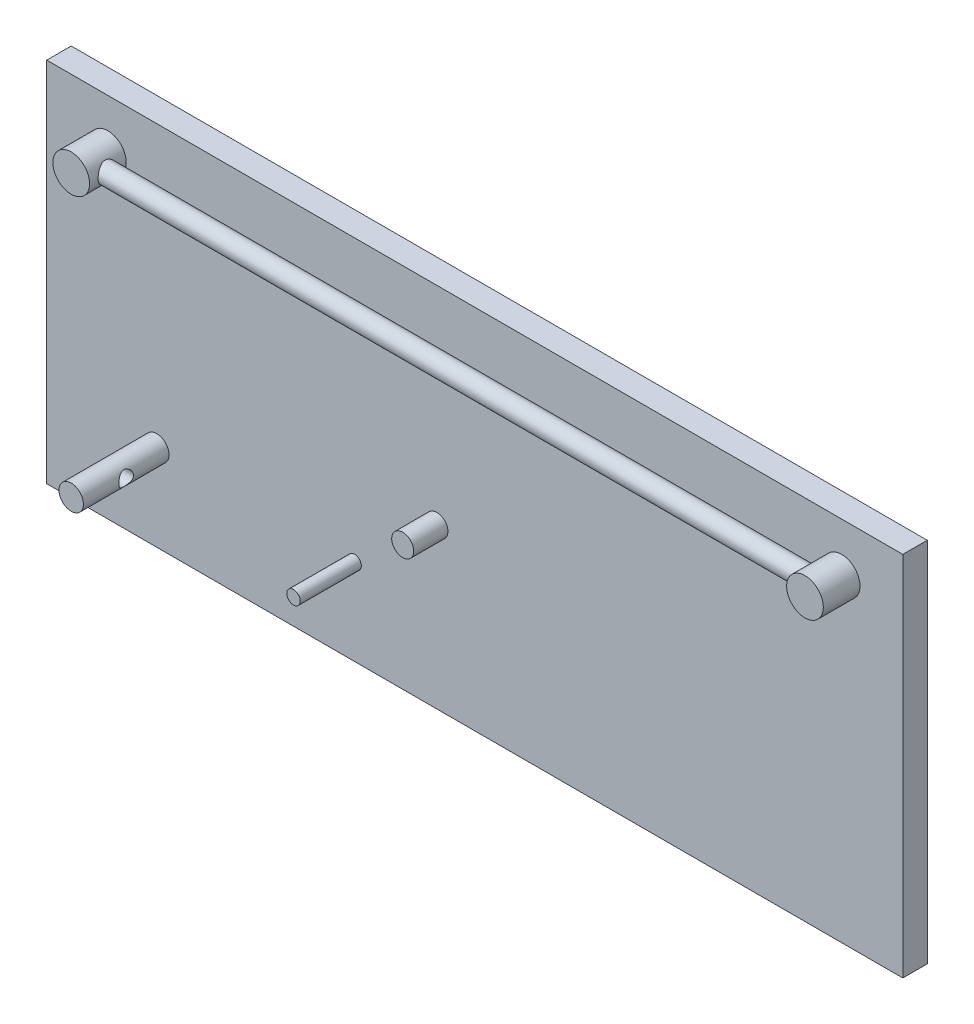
from build123d import *

# Parameters (mm, degrees)
SKETCH1_W                       = 350
SKETCH1_H                       = 150
EXTRUDE1_DEPTH                  = 10
SKETCH2_R                       = 7.5
EXTRUDE2_DEPTH                  = 15
EXTRUDE3_REACH                  = 194.029
EXTRUDE3_END_RADIUS             = 7.5
SKETCH3_R                       = 4
EXTRUDE3_DIRECTION_2_REACH      = 194.029
EXTRUDE3_DIRECTION_2_END_RADIUS = 7.5
SKETCH4_R                       = 4.5
EXTRUDE4_DEPTH                  = 14
SKETCH5_R                       = 5
EXTRUDE5_DEPTH                  = 35
CUT_EXTRUDE1_REACH              = 362.763
SKETCH6_R                       = 3
SKETCH7_R                       = 2.75
EXTRUDE6_DEPTH                  = 25


with BuildPart() as part:
    # Sketch1 → Extrude1 (new body)
    with BuildSketch(Plane.XY):
        Rectangle(SKETCH1_W, SKETCH1_H)
    extrude(amount=EXTRUDE1_DEPTH)

    # Sketch2 → Extrude2 (add)
    with BuildSketch(Plane.XY.offset(10)):
        with Locations((150, 55)):
            Circle(SKETCH2_R)
        with Locations(Location((-150, 55, 0), (0, 0, 180))):
            Circle(SKETCH2_R)
    extrude(amount=EXTRUDE2_DEPTH)

    # Extrude3: up to this cylinder (the profile starts outside it)
    extrude3_end = Plane(origin=(150, 55, 17.5), z_dir=(0, 0, -1)) * Cylinder(EXTRUDE3_END_RADIUS, 404.058, mode=Mode.PRIVATE)
    # Sketch3 → Extrude3 (add, up to the surface)
    with BuildSketch(Plane(origin=(0, 0, 0), x_dir=(0, 0, -1), z_dir=(1, 0, 0)), mode=Mode.PRIVATE) as extrude3_sk1:
        with Locations(Location((-17.5, 55, 0), (0, 0, 180))):
            Circle(SKETCH3_R)
    extrude3_tool1 = extrude(extrude3_sk1.sketch, amount=EXTRUDE3_REACH, mode=Mode.PRIVATE) - extrude3_end
    add(extrude3_tool1.solids().sort_by_distance((0, 55, 17.5))[0])

    # Extrude3 direction 2: up to this cylinder (the profile starts outside it)
    extrude3_direction_2_end = Plane(origin=(-150, 55, 17.5), z_dir=(0, 0, -1)) * Cylinder(EXTRUDE3_DIRECTION_2_END_RADIUS, 404.058, mode=Mode.PRIVATE)
    # Sketch3 → Extrude3 direction 2 (add, up to the surface)
    with BuildSketch(Plane(origin=(0, 0, 0), x_dir=(0, 0, -1), z_dir=(1, 0, 0)), mode=Mode.PRIVATE) as extrude3_direction_2_sk1:
        with Locations(Location((-17.5, 55, 0), (0, 0, 180))):
            Circle(SKETCH3_R)
    extrude3_direction_2_tool1 = extrude(extrude3_direction_2_sk1.sketch, amount=-EXTRUDE3_DIRECTION_2_REACH, mode=Mode.PRIVATE) - extrude3_direction_2_end
    add(extrude3_direction_2_tool1.solids().sort_by_distance((0, 55, 17.5))[0])

    # Sketch4 → Extrude4 (add)
    with BuildSketch(Plane.XY.offset(10)):
        with Locations((-15.474029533, -9.878372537)):
            Circle(SKETCH4_R)
    extrude(amount=EXTRUDE4_DEPTH)

    # Sketch5 → Extrude5 (add)
    with BuildSketch(Plane.XY.offset(10)):
        with Locations((-130, -39.762371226)):
            Circle(SKETCH5_R)
    extrude(amount=EXTRUDE5_DEPTH)

    # Sketch6 → Cut-Extrude1 (cut, up to next)
    with BuildSketch(Plane.ZY.offset(175), mode=Mode.PRIVATE) as cut_extrude1_sk1:
        with Locations((27.5, -39.762371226)):
            Circle(SKETCH6_R)
    cut_extrude1_tool1 = extrude(cut_extrude1_sk1.sketch, amount=-CUT_EXTRUDE1_REACH, mode=Mode.PRIVATE) & part.part
    add(cut_extrude1_tool1.solids().sort_by_distance((-175, -39.762371, 27.5))[0], mode=Mode.SUBTRACT)

    # Sketch7 → Extrude6 (add)
    with BuildSketch(Plane.XY.offset(10)):
        with Locations((-49.118443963, -39.762371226)):
            Circle(SKETCH7_R)
    extrude(amount=EXTRUDE6_DEPTH)


solid = part.part
